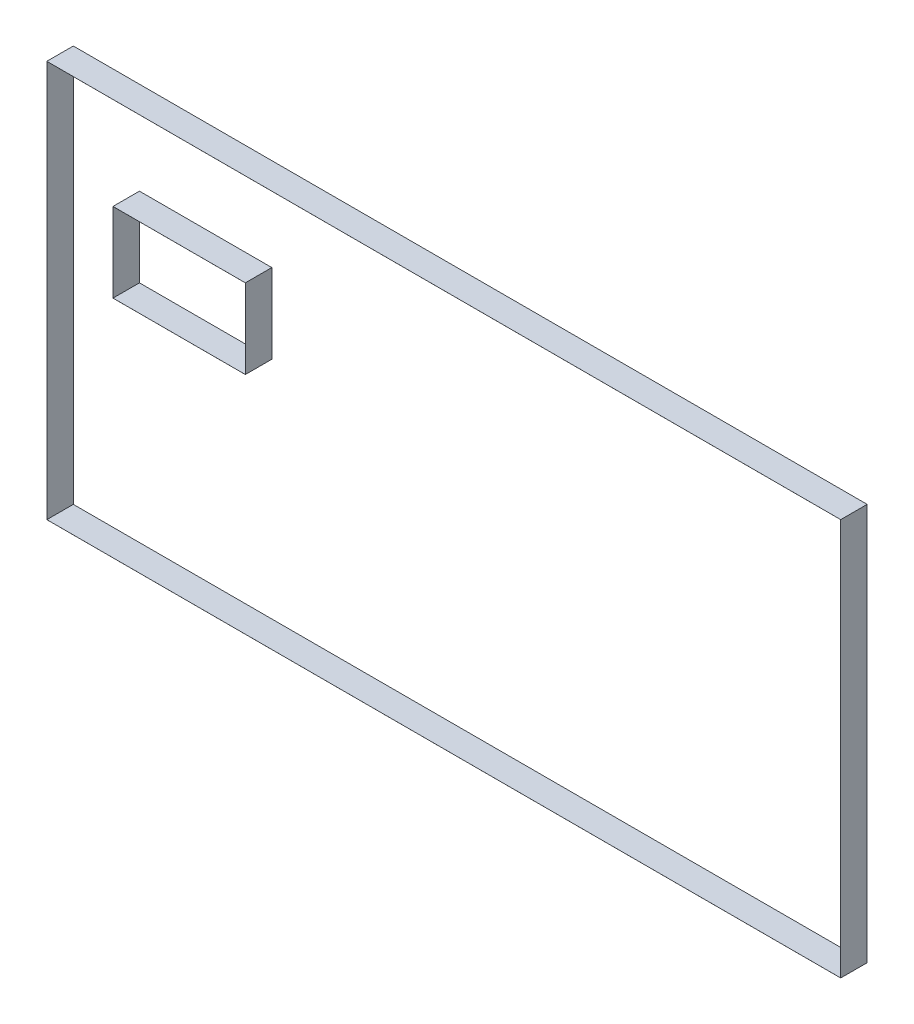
ISO-10303-21;
HEADER;
FILE_DESCRIPTION(('STEP AP214'),'2;1');
FILE_NAME('part.step','',(''),(''),'','','');
FILE_SCHEMA(('AUTOMOTIVE_DESIGN { 1 0 10303 214 1 1 1 1 }'));
ENDSEC;
DATA;
#1=APPLICATION_CONTEXT('core data for automotive mechanical design processes');
#2=APPLICATION_PROTOCOL_DEFINITION('international standard','automotive_design',2000,#1);
#3=PRODUCT_CONTEXT('',#1,'mechanical');
#4=PRODUCT('Part','Part','',(#3));
#5=PRODUCT_RELATED_PRODUCT_CATEGORY('part','',(#4));
#6=PRODUCT_DEFINITION_FORMATION('','',#4);
#7=PRODUCT_DEFINITION_CONTEXT('part definition',#1,'design');
#8=PRODUCT_DEFINITION('design','',#6,#7);
#9=PRODUCT_DEFINITION_SHAPE('','',#8);
#10=(LENGTH_UNIT() NAMED_UNIT(*) SI_UNIT(.MILLI.,.METRE.));
#11=(NAMED_UNIT(*) PLANE_ANGLE_UNIT() SI_UNIT($,.RADIAN.));
#12=(NAMED_UNIT(*) SI_UNIT($,.STERADIAN.) SOLID_ANGLE_UNIT());
#13=UNCERTAINTY_MEASURE_WITH_UNIT(LENGTH_MEASURE(1.E-05),#10,'distance_accuracy_value','');
#14=(GEOMETRIC_REPRESENTATION_CONTEXT(3) GLOBAL_UNCERTAINTY_ASSIGNED_CONTEXT((#13)) GLOBAL_UNIT_ASSIGNED_CONTEXT((#10,
#11,#12)) REPRESENTATION_CONTEXT('',''));
#15=CARTESIAN_POINT('',(0.,0.,0.));
#16=DIRECTION('',(0.,0.,1.));
#17=DIRECTION('',(1.,0.,0.));
#18=AXIS2_PLACEMENT_3D('',#15,#16,#17);
#19=CARTESIAN_POINT('',(0.,0.,1.));
#20=DIRECTION('',(0.,0.,1.));
#21=DIRECTION('',(1.,0.,0.));
#22=AXIS2_PLACEMENT_3D('',#19,#20,#21);
#23=PLANE('',#22);
#24=DIRECTION('',(0.,-1.,0.));
#25=VECTOR('',#24,1.);
#26=CARTESIAN_POINT('',(2.499,11.5,1.));
#27=LINE('',#26,#25);
#28=CARTESIAN_POINT('',(2.499,11.501,1.));
#29=VERTEX_POINT('',#28);
#30=CARTESIAN_POINT('',(2.499,8.499,1.));
#31=VERTEX_POINT('',#30);
#32=EDGE_CURVE('E294',#29,#31,#27,.T.);
#33=ORIENTED_EDGE('',*,*,#32,.T.);
#34=DIRECTION('',(1.,0.,0.));
#35=VECTOR('',#34,1.);
#36=CARTESIAN_POINT('',(2.5,8.499,1.));
#37=LINE('',#36,#35);
#38=CARTESIAN_POINT('',(7.501,8.499,1.));
#39=VERTEX_POINT('',#38);
#40=EDGE_CURVE('E297',#31,#39,#37,.T.);
#41=ORIENTED_EDGE('',*,*,#40,.T.);
#42=DIRECTION('',(0.,1.,0.));
#43=VECTOR('',#42,1.);
#44=CARTESIAN_POINT('',(7.501,11.5,1.));
#45=LINE('',#44,#43);
#46=CARTESIAN_POINT('',(7.501,11.501,1.));
#47=VERTEX_POINT('',#46);
#48=EDGE_CURVE('E300',#39,#47,#45,.T.);
#49=ORIENTED_EDGE('',*,*,#48,.T.);
#50=DIRECTION('',(-1.,0.,0.));
#51=VECTOR('',#50,1.);
#52=CARTESIAN_POINT('',(2.5,11.501,1.));
#53=LINE('',#52,#51);
#54=EDGE_CURVE('E302',#47,#29,#53,.T.);
#55=ORIENTED_EDGE('',*,*,#54,.T.);
#56=EDGE_LOOP('',(#33,#41,#49,#55));
#57=FACE_BOUND('',#56,.T.);
#58=DIRECTION('',(1.,0.,0.));
#59=VECTOR('',#58,1.);
#60=CARTESIAN_POINT('',(2.5,8.5,1.));
#61=LINE('',#60,#59);
#62=CARTESIAN_POINT('',(2.5,8.5,1.));
#63=VERTEX_POINT('',#62);
#64=CARTESIAN_POINT('',(7.5,8.5,1.));
#65=VERTEX_POINT('',#64);
#66=EDGE_CURVE('E266',#63,#65,#61,.T.);
#67=ORIENTED_EDGE('',*,*,#66,.F.);
#68=DIRECTION('',(0.,-1.,0.));
#69=VECTOR('',#68,1.);
#70=CARTESIAN_POINT('',(2.5,11.5,1.));
#71=LINE('',#70,#69);
#72=CARTESIAN_POINT('',(2.5,11.5,1.));
#73=VERTEX_POINT('',#72);
#74=EDGE_CURVE('E258',#73,#63,#71,.T.);
#75=ORIENTED_EDGE('',*,*,#74,.F.);
#76=DIRECTION('',(-1.,0.,0.));
#77=VECTOR('',#76,1.);
#78=CARTESIAN_POINT('',(2.5,11.5,1.));
#79=LINE('',#78,#77);
#80=CARTESIAN_POINT('',(7.5,11.5,1.));
#81=VERTEX_POINT('',#80);
#82=EDGE_CURVE('E280',#81,#73,#79,.T.);
#83=ORIENTED_EDGE('',*,*,#82,.F.);
#84=DIRECTION('',(0.,1.,0.));
#85=VECTOR('',#84,1.);
#86=CARTESIAN_POINT('',(7.5,11.5,1.));
#87=LINE('',#86,#85);
#88=EDGE_CURVE('E278',#65,#81,#87,.T.);
#89=ORIENTED_EDGE('',*,*,#88,.F.);
#90=EDGE_LOOP('',(#67,#75,#83,#89));
#91=FACE_BOUND('',#90,.T.);
#92=ADVANCED_FACE('F193',(#57,#91),#23,.T.);
#93=CARTESIAN_POINT('',(0.,0.,0.));
#94=DIRECTION('',(0.,0.,1.));
#95=DIRECTION('',(1.,0.,0.));
#96=AXIS2_PLACEMENT_3D('',#93,#94,#95);
#97=PLANE('',#96);
#98=DIRECTION('',(0.,-1.,0.));
#99=VECTOR('',#98,1.);
#100=CARTESIAN_POINT('',(2.499,11.5,0.));
#101=LINE('',#100,#99);
#102=CARTESIAN_POINT('',(2.499,11.501,0.));
#103=VERTEX_POINT('',#102);
#104=CARTESIAN_POINT('',(2.499,8.499,0.));
#105=VERTEX_POINT('',#104);
#106=EDGE_CURVE('E274',#103,#105,#101,.T.);
#107=ORIENTED_EDGE('',*,*,#106,.F.);
#108=DIRECTION('',(-1.,0.,0.));
#109=VECTOR('',#108,1.);
#110=CARTESIAN_POINT('',(2.5,11.501,0.));
#111=LINE('',#110,#109);
#112=CARTESIAN_POINT('',(7.501,11.501,0.));
#113=VERTEX_POINT('',#112);
#114=EDGE_CURVE('E298',#113,#103,#111,.T.);
#115=ORIENTED_EDGE('',*,*,#114,.F.);
#116=DIRECTION('',(0.,1.,0.));
#117=VECTOR('',#116,1.);
#118=CARTESIAN_POINT('',(7.501,11.5,0.));
#119=LINE('',#118,#117);
#120=CARTESIAN_POINT('',(7.501,8.499,0.));
#121=VERTEX_POINT('',#120);
#122=EDGE_CURVE('E309',#121,#113,#119,.T.);
#123=ORIENTED_EDGE('',*,*,#122,.F.);
#124=DIRECTION('',(1.,0.,0.));
#125=VECTOR('',#124,1.);
#126=CARTESIAN_POINT('',(2.5,8.499,0.));
#127=LINE('',#126,#125);
#128=EDGE_CURVE('E307',#105,#121,#127,.T.);
#129=ORIENTED_EDGE('',*,*,#128,.F.);
#130=EDGE_LOOP('',(#107,#115,#123,#129));
#131=FACE_BOUND('',#130,.T.);
#132=DIRECTION('',(0.,-1.,0.));
#133=VECTOR('',#132,1.);
#134=CARTESIAN_POINT('',(2.5,11.5,0.));
#135=LINE('',#134,#133);
#136=CARTESIAN_POINT('',(2.5,11.5,0.));
#137=VERTEX_POINT('',#136);
#138=CARTESIAN_POINT('',(2.5,8.5,0.));
#139=VERTEX_POINT('',#138);
#140=EDGE_CURVE('E216',#137,#139,#135,.T.);
#141=ORIENTED_EDGE('',*,*,#140,.T.);
#142=DIRECTION('',(1.,0.,0.));
#143=VECTOR('',#142,1.);
#144=CARTESIAN_POINT('',(2.5,8.5,0.));
#145=LINE('',#144,#143);
#146=CARTESIAN_POINT('',(7.5,8.5,0.));
#147=VERTEX_POINT('',#146);
#148=EDGE_CURVE('E273',#139,#147,#145,.T.);
#149=ORIENTED_EDGE('',*,*,#148,.T.);
#150=DIRECTION('',(0.,1.,0.));
#151=VECTOR('',#150,1.);
#152=CARTESIAN_POINT('',(7.5,11.5,0.));
#153=LINE('',#152,#151);
#154=CARTESIAN_POINT('',(7.5,11.5,0.));
#155=VERTEX_POINT('',#154);
#156=EDGE_CURVE('E286',#147,#155,#153,.T.);
#157=ORIENTED_EDGE('',*,*,#156,.T.);
#158=DIRECTION('',(-1.,0.,0.));
#159=VECTOR('',#158,1.);
#160=CARTESIAN_POINT('',(2.5,11.5,0.));
#161=LINE('',#160,#159);
#162=EDGE_CURVE('E267',#155,#137,#161,.T.);
#163=ORIENTED_EDGE('',*,*,#162,.T.);
#164=EDGE_LOOP('',(#141,#149,#157,#163));
#165=FACE_BOUND('',#164,.T.);
#166=ADVANCED_FACE('F327',(#131,#165),#97,.F.);
#167=CARTESIAN_POINT('',(2.499,11.5,1.));
#168=DIRECTION('',(1.,0.,0.));
#169=DIRECTION('',(0.,1.,0.));
#170=AXIS2_PLACEMENT_3D('',#167,#168,#169);
#171=PLANE('',#170);
#172=ORIENTED_EDGE('',*,*,#106,.T.);
#173=DIRECTION('',(0.,0.,-1.));
#174=VECTOR('',#173,1.);
#175=CARTESIAN_POINT('',(2.499,8.499,1.));
#176=LINE('',#175,#174);
#177=EDGE_CURVE('E13',#31,#105,#176,.T.);
#178=ORIENTED_EDGE('',*,*,#177,.F.);
#179=ORIENTED_EDGE('',*,*,#32,.F.);
#180=DIRECTION('',(0.,0.,-1.));
#181=VECTOR('',#180,1.);
#182=CARTESIAN_POINT('',(2.499,11.501,1.));
#183=LINE('',#182,#181);
#184=EDGE_CURVE('E304',#29,#103,#183,.T.);
#185=ORIENTED_EDGE('',*,*,#184,.T.);
#186=EDGE_LOOP('',(#172,#178,#179,#185));
#187=FACE_BOUND('',#186,.T.);
#188=ADVANCED_FACE('F195',(#187),#171,.F.);
#189=CARTESIAN_POINT('',(2.5,8.499,1.));
#190=DIRECTION('',(0.,1.,0.));
#191=DIRECTION('',(0.,0.,1.));
#192=AXIS2_PLACEMENT_3D('',#189,#190,#191);
#193=PLANE('',#192);
#194=ORIENTED_EDGE('',*,*,#128,.T.);
#195=DIRECTION('',(0.,0.,-1.));
#196=VECTOR('',#195,1.);
#197=CARTESIAN_POINT('',(7.501,8.499,1.));
#198=LINE('',#197,#196);
#199=EDGE_CURVE('E201',#39,#121,#198,.T.);
#200=ORIENTED_EDGE('',*,*,#199,.F.);
#201=ORIENTED_EDGE('',*,*,#40,.F.);
#202=ORIENTED_EDGE('',*,*,#177,.T.);
#203=EDGE_LOOP('',(#194,#200,#201,#202));
#204=FACE_BOUND('',#203,.T.);
#205=ADVANCED_FACE('F337',(#204),#193,.F.);
#206=CARTESIAN_POINT('',(7.501,11.5,1.));
#207=DIRECTION('',(-1.,0.,0.));
#208=DIRECTION('',(0.,0.,1.));
#209=AXIS2_PLACEMENT_3D('',#206,#207,#208);
#210=PLANE('',#209);
#211=ORIENTED_EDGE('',*,*,#122,.T.);
#212=DIRECTION('',(0.,0.,-1.));
#213=VECTOR('',#212,1.);
#214=CARTESIAN_POINT('',(7.501,11.501,1.));
#215=LINE('',#214,#213);
#216=EDGE_CURVE('E314',#47,#113,#215,.T.);
#217=ORIENTED_EDGE('',*,*,#216,.F.);
#218=ORIENTED_EDGE('',*,*,#48,.F.);
#219=ORIENTED_EDGE('',*,*,#199,.T.);
#220=EDGE_LOOP('',(#211,#217,#218,#219));
#221=FACE_BOUND('',#220,.T.);
#222=ADVANCED_FACE('F321',(#221),#210,.F.);
#223=CARTESIAN_POINT('',(2.5,11.501,1.));
#224=DIRECTION('',(0.,-1.,0.));
#225=DIRECTION('',(0.,0.,-1.));
#226=AXIS2_PLACEMENT_3D('',#223,#224,#225);
#227=PLANE('',#226);
#228=ORIENTED_EDGE('',*,*,#114,.T.);
#229=ORIENTED_EDGE('',*,*,#184,.F.);
#230=ORIENTED_EDGE('',*,*,#54,.F.);
#231=ORIENTED_EDGE('',*,*,#216,.T.);
#232=EDGE_LOOP('',(#228,#229,#230,#231));
#233=FACE_BOUND('',#232,.T.);
#234=ADVANCED_FACE('F331',(#233),#227,.F.);
#235=CARTESIAN_POINT('',(2.5,11.5,1.));
#236=DIRECTION('',(1.,0.,0.));
#237=DIRECTION('',(0.,1.,0.));
#238=AXIS2_PLACEMENT_3D('',#235,#236,#237);
#239=PLANE('',#238);
#240=ORIENTED_EDGE('',*,*,#140,.F.);
#241=DIRECTION('',(0.,0.,-1.));
#242=VECTOR('',#241,1.);
#243=CARTESIAN_POINT('',(2.5,11.5,1.));
#244=LINE('',#243,#242);
#245=EDGE_CURVE('E262',#73,#137,#244,.T.);
#246=ORIENTED_EDGE('',*,*,#245,.F.);
#247=ORIENTED_EDGE('',*,*,#74,.T.);
#248=DIRECTION('',(0.,0.,-1.));
#249=VECTOR('',#248,1.);
#250=CARTESIAN_POINT('',(2.5,8.5,1.));
#251=LINE('',#250,#249);
#252=EDGE_CURVE('E261',#63,#139,#251,.T.);
#253=ORIENTED_EDGE('',*,*,#252,.T.);
#254=EDGE_LOOP('',(#240,#246,#247,#253));
#255=FACE_BOUND('',#254,.T.);
#256=ADVANCED_FACE('F260',(#255),#239,.T.);
#257=CARTESIAN_POINT('',(2.5,8.5,1.));
#258=DIRECTION('',(0.,1.,0.));
#259=DIRECTION('',(0.,0.,1.));
#260=AXIS2_PLACEMENT_3D('',#257,#258,#259);
#261=PLANE('',#260);
#262=ORIENTED_EDGE('',*,*,#148,.F.);
#263=ORIENTED_EDGE('',*,*,#252,.F.);
#264=ORIENTED_EDGE('',*,*,#66,.T.);
#265=DIRECTION('',(0.,0.,-1.));
#266=VECTOR('',#265,1.);
#267=CARTESIAN_POINT('',(7.5,8.5,1.));
#268=LINE('',#267,#266);
#269=EDGE_CURVE('E275',#65,#147,#268,.T.);
#270=ORIENTED_EDGE('',*,*,#269,.T.);
#271=EDGE_LOOP('',(#262,#263,#264,#270));
#272=FACE_BOUND('',#271,.T.);
#273=ADVANCED_FACE('F270',(#272),#261,.T.);
#274=CARTESIAN_POINT('',(7.5,11.5,1.));
#275=DIRECTION('',(-1.,0.,0.));
#276=DIRECTION('',(0.,0.,1.));
#277=AXIS2_PLACEMENT_3D('',#274,#275,#276);
#278=PLANE('',#277);
#279=ORIENTED_EDGE('',*,*,#156,.F.);
#280=ORIENTED_EDGE('',*,*,#269,.F.);
#281=ORIENTED_EDGE('',*,*,#88,.T.);
#282=DIRECTION('',(0.,0.,-1.));
#283=VECTOR('',#282,1.);
#284=CARTESIAN_POINT('',(7.5,11.5,1.));
#285=LINE('',#284,#283);
#286=EDGE_CURVE('E208',#81,#155,#285,.T.);
#287=ORIENTED_EDGE('',*,*,#286,.T.);
#288=EDGE_LOOP('',(#279,#280,#281,#287));
#289=FACE_BOUND('',#288,.T.);
#290=ADVANCED_FACE('F360',(#289),#278,.T.);
#291=CARTESIAN_POINT('',(2.5,11.5,1.));
#292=DIRECTION('',(0.,-1.,0.));
#293=DIRECTION('',(0.,0.,-1.));
#294=AXIS2_PLACEMENT_3D('',#291,#292,#293);
#295=PLANE('',#294);
#296=ORIENTED_EDGE('',*,*,#162,.F.);
#297=ORIENTED_EDGE('',*,*,#286,.F.);
#298=ORIENTED_EDGE('',*,*,#82,.T.);
#299=ORIENTED_EDGE('',*,*,#245,.T.);
#300=EDGE_LOOP('',(#296,#297,#298,#299));
#301=FACE_BOUND('',#300,.T.);
#302=ADVANCED_FACE('F364',(#301),#295,.T.);
#303=CLOSED_SHELL('',(#92,#166,#188,#205,#222,#234,#256,#273,#290,#302));
#304=MANIFOLD_SOLID_BREP('B2',#303);
#305=CARTESIAN_POINT('',(0.,0.,1.));
#306=DIRECTION('',(0.,0.,1.));
#307=DIRECTION('',(1.,0.,0.));
#308=AXIS2_PLACEMENT_3D('',#305,#306,#307);
#309=PLANE('',#308);
#310=DIRECTION('',(0.,-1.,0.));
#311=VECTOR('',#310,1.);
#312=CARTESIAN_POINT('',(-0.001,0.,1.));
#313=LINE('',#312,#311);
#314=CARTESIAN_POINT('',(-0.001,15.001,1.));
#315=VERTEX_POINT('',#314);
#316=CARTESIAN_POINT('',(-0.001,-0.001,1.));
#317=VERTEX_POINT('',#316);
#318=EDGE_CURVE('E564',#315,#317,#313,.T.);
#319=ORIENTED_EDGE('',*,*,#318,.T.);
#320=DIRECTION('',(1.,0.,0.));
#321=VECTOR('',#320,1.);
#322=CARTESIAN_POINT('',(0.,-0.001,1.));
#323=LINE('',#322,#321);
#324=CARTESIAN_POINT('',(30.001,-0.001,1.));
#325=VERTEX_POINT('',#324);
#326=EDGE_CURVE('E567',#317,#325,#323,.T.);
#327=ORIENTED_EDGE('',*,*,#326,.T.);
#328=DIRECTION('',(0.,1.,0.));
#329=VECTOR('',#328,1.);
#330=CARTESIAN_POINT('',(30.001,0.,1.));
#331=LINE('',#330,#329);
#332=CARTESIAN_POINT('',(30.001,15.001,1.));
#333=VERTEX_POINT('',#332);
#334=EDGE_CURVE('E570',#325,#333,#331,.T.);
#335=ORIENTED_EDGE('',*,*,#334,.T.);
#336=DIRECTION('',(-1.,0.,0.));
#337=VECTOR('',#336,1.);
#338=CARTESIAN_POINT('',(0.,15.001,1.));
#339=LINE('',#338,#337);
#340=EDGE_CURVE('E572',#333,#315,#339,.T.);
#341=ORIENTED_EDGE('',*,*,#340,.T.);
#342=EDGE_LOOP('',(#319,#327,#335,#341));
#343=FACE_BOUND('',#342,.T.);
#344=DIRECTION('',(1.,0.,0.));
#345=VECTOR('',#344,1.);
#346=CARTESIAN_POINT('',(0.,0.,1.));
#347=LINE('',#346,#345);
#348=CARTESIAN_POINT('',(0.,0.,1.));
#349=VERTEX_POINT('',#348);
#350=CARTESIAN_POINT('',(30.,0.,1.));
#351=VERTEX_POINT('',#350);
#352=EDGE_CURVE('E536',#349,#351,#347,.T.);
#353=ORIENTED_EDGE('',*,*,#352,.F.);
#354=DIRECTION('',(0.,-1.,0.));
#355=VECTOR('',#354,1.);
#356=CARTESIAN_POINT('',(0.,0.,1.));
#357=LINE('',#356,#355);
#358=CARTESIAN_POINT('',(0.,15.,1.));
#359=VERTEX_POINT('',#358);
#360=EDGE_CURVE('E528',#359,#349,#357,.T.);
#361=ORIENTED_EDGE('',*,*,#360,.F.);
#362=DIRECTION('',(-1.,0.,0.));
#363=VECTOR('',#362,1.);
#364=CARTESIAN_POINT('',(0.,15.,1.));
#365=LINE('',#364,#363);
#366=CARTESIAN_POINT('',(30.,15.,1.));
#367=VERTEX_POINT('',#366);
#368=EDGE_CURVE('E550',#367,#359,#365,.T.);
#369=ORIENTED_EDGE('',*,*,#368,.F.);
#370=DIRECTION('',(0.,1.,0.));
#371=VECTOR('',#370,1.);
#372=CARTESIAN_POINT('',(30.,0.,1.));
#373=LINE('',#372,#371);
#374=EDGE_CURVE('E548',#351,#367,#373,.T.);
#375=ORIENTED_EDGE('',*,*,#374,.F.);
#376=EDGE_LOOP('',(#353,#361,#369,#375));
#377=FACE_BOUND('',#376,.T.);
#378=ADVANCED_FACE('F463',(#343,#377),#309,.T.);
#379=CARTESIAN_POINT('',(0.,0.,0.));
#380=DIRECTION('',(0.,0.,1.));
#381=DIRECTION('',(1.,0.,0.));
#382=AXIS2_PLACEMENT_3D('',#379,#380,#381);
#383=PLANE('',#382);
#384=DIRECTION('',(0.,-1.,0.));
#385=VECTOR('',#384,1.);
#386=CARTESIAN_POINT('',(-0.001,0.,0.));
#387=LINE('',#386,#385);
#388=CARTESIAN_POINT('',(-0.001,15.001,0.));
#389=VERTEX_POINT('',#388);
#390=CARTESIAN_POINT('',(-0.001,-0.001,0.));
#391=VERTEX_POINT('',#390);
#392=EDGE_CURVE('E544',#389,#391,#387,.T.);
#393=ORIENTED_EDGE('',*,*,#392,.F.);
#394=DIRECTION('',(-1.,0.,0.));
#395=VECTOR('',#394,1.);
#396=CARTESIAN_POINT('',(0.,15.001,0.));
#397=LINE('',#396,#395);
#398=CARTESIAN_POINT('',(30.001,15.001,0.));
#399=VERTEX_POINT('',#398);
#400=EDGE_CURVE('E568',#399,#389,#397,.T.);
#401=ORIENTED_EDGE('',*,*,#400,.F.);
#402=DIRECTION('',(0.,1.,0.));
#403=VECTOR('',#402,1.);
#404=CARTESIAN_POINT('',(30.001,0.,0.));
#405=LINE('',#404,#403);
#406=CARTESIAN_POINT('',(30.001,-0.001,0.));
#407=VERTEX_POINT('',#406);
#408=EDGE_CURVE('E579',#407,#399,#405,.T.);
#409=ORIENTED_EDGE('',*,*,#408,.F.);
#410=DIRECTION('',(1.,0.,0.));
#411=VECTOR('',#410,1.);
#412=CARTESIAN_POINT('',(0.,-0.001,0.));
#413=LINE('',#412,#411);
#414=EDGE_CURVE('E577',#391,#407,#413,.T.);
#415=ORIENTED_EDGE('',*,*,#414,.F.);
#416=EDGE_LOOP('',(#393,#401,#409,#415));
#417=FACE_BOUND('',#416,.T.);
#418=DIRECTION('',(0.,-1.,0.));
#419=VECTOR('',#418,1.);
#420=CARTESIAN_POINT('',(0.,0.,0.));
#421=LINE('',#420,#419);
#422=CARTESIAN_POINT('',(0.,15.,0.));
#423=VERTEX_POINT('',#422);
#424=CARTESIAN_POINT('',(0.,0.,0.));
#425=VERTEX_POINT('',#424);
#426=EDGE_CURVE('E486',#423,#425,#421,.T.);
#427=ORIENTED_EDGE('',*,*,#426,.T.);
#428=DIRECTION('',(1.,0.,0.));
#429=VECTOR('',#428,1.);
#430=CARTESIAN_POINT('',(0.,0.,0.));
#431=LINE('',#430,#429);
#432=CARTESIAN_POINT('',(30.,0.,0.));
#433=VERTEX_POINT('',#432);
#434=EDGE_CURVE('E543',#425,#433,#431,.T.);
#435=ORIENTED_EDGE('',*,*,#434,.T.);
#436=DIRECTION('',(0.,1.,0.));
#437=VECTOR('',#436,1.);
#438=CARTESIAN_POINT('',(30.,0.,0.));
#439=LINE('',#438,#437);
#440=CARTESIAN_POINT('',(30.,15.,0.));
#441=VERTEX_POINT('',#440);
#442=EDGE_CURVE('E556',#433,#441,#439,.T.);
#443=ORIENTED_EDGE('',*,*,#442,.T.);
#444=DIRECTION('',(-1.,0.,0.));
#445=VECTOR('',#444,1.);
#446=CARTESIAN_POINT('',(0.,15.,0.));
#447=LINE('',#446,#445);
#448=EDGE_CURVE('E537',#441,#423,#447,.T.);
#449=ORIENTED_EDGE('',*,*,#448,.T.);
#450=EDGE_LOOP('',(#427,#435,#443,#449));
#451=FACE_BOUND('',#450,.T.);
#452=ADVANCED_FACE('F597',(#417,#451),#383,.F.);
#453=CARTESIAN_POINT('',(-0.001,0.,1.));
#454=DIRECTION('',(1.,0.,0.));
#455=DIRECTION('',(0.,0.,-1.));
#456=AXIS2_PLACEMENT_3D('',#453,#454,#455);
#457=PLANE('',#456);
#458=ORIENTED_EDGE('',*,*,#392,.T.);
#459=DIRECTION('',(0.,0.,-1.));
#460=VECTOR('',#459,1.);
#461=CARTESIAN_POINT('',(-0.001,-0.001,1.));
#462=LINE('',#461,#460);
#463=EDGE_CURVE('E191',#317,#391,#462,.T.);
#464=ORIENTED_EDGE('',*,*,#463,.F.);
#465=ORIENTED_EDGE('',*,*,#318,.F.);
#466=DIRECTION('',(0.,0.,-1.));
#467=VECTOR('',#466,1.);
#468=CARTESIAN_POINT('',(-0.001,15.001,1.));
#469=LINE('',#468,#467);
#470=EDGE_CURVE('E574',#315,#389,#469,.T.);
#471=ORIENTED_EDGE('',*,*,#470,.T.);
#472=EDGE_LOOP('',(#458,#464,#465,#471));
#473=FACE_BOUND('',#472,.T.);
#474=ADVANCED_FACE('F465',(#473),#457,.F.);
#475=CARTESIAN_POINT('',(0.,-0.001,1.));
#476=DIRECTION('',(0.,1.,0.));
#477=DIRECTION('',(0.,0.,1.));
#478=AXIS2_PLACEMENT_3D('',#475,#476,#477);
#479=PLANE('',#478);
#480=ORIENTED_EDGE('',*,*,#414,.T.);
#481=DIRECTION('',(0.,0.,-1.));
#482=VECTOR('',#481,1.);
#483=CARTESIAN_POINT('',(30.001,-0.001,1.));
#484=LINE('',#483,#482);
#485=EDGE_CURVE('E471',#325,#407,#484,.T.);
#486=ORIENTED_EDGE('',*,*,#485,.F.);
#487=ORIENTED_EDGE('',*,*,#326,.F.);
#488=ORIENTED_EDGE('',*,*,#463,.T.);
#489=EDGE_LOOP('',(#480,#486,#487,#488));
#490=FACE_BOUND('',#489,.T.);
#491=ADVANCED_FACE('F607',(#490),#479,.F.);
#492=CARTESIAN_POINT('',(30.001,0.,1.));
#493=DIRECTION('',(-1.,0.,0.));
#494=DIRECTION('',(0.,0.,1.));
#495=AXIS2_PLACEMENT_3D('',#492,#493,#494);
#496=PLANE('',#495);
#497=ORIENTED_EDGE('',*,*,#408,.T.);
#498=DIRECTION('',(0.,0.,-1.));
#499=VECTOR('',#498,1.);
#500=CARTESIAN_POINT('',(30.001,15.001,1.));
#501=LINE('',#500,#499);
#502=EDGE_CURVE('E584',#333,#399,#501,.T.);
#503=ORIENTED_EDGE('',*,*,#502,.F.);
#504=ORIENTED_EDGE('',*,*,#334,.F.);
#505=ORIENTED_EDGE('',*,*,#485,.T.);
#506=EDGE_LOOP('',(#497,#503,#504,#505));
#507=FACE_BOUND('',#506,.T.);
#508=ADVANCED_FACE('F591',(#507),#496,.F.);
#509=CARTESIAN_POINT('',(0.,15.001,1.));
#510=DIRECTION('',(0.,-1.,0.));
#511=DIRECTION('',(0.,0.,-1.));
#512=AXIS2_PLACEMENT_3D('',#509,#510,#511);
#513=PLANE('',#512);
#514=ORIENTED_EDGE('',*,*,#400,.T.);
#515=ORIENTED_EDGE('',*,*,#470,.F.);
#516=ORIENTED_EDGE('',*,*,#340,.F.);
#517=ORIENTED_EDGE('',*,*,#502,.T.);
#518=EDGE_LOOP('',(#514,#515,#516,#517));
#519=FACE_BOUND('',#518,.T.);
#520=ADVANCED_FACE('F601',(#519),#513,.F.);
#521=CARTESIAN_POINT('',(0.,0.,1.));
#522=DIRECTION('',(1.,0.,0.));
#523=DIRECTION('',(0.,0.,-1.));
#524=AXIS2_PLACEMENT_3D('',#521,#522,#523);
#525=PLANE('',#524);
#526=ORIENTED_EDGE('',*,*,#426,.F.);
#527=DIRECTION('',(0.,0.,-1.));
#528=VECTOR('',#527,1.);
#529=CARTESIAN_POINT('',(0.,15.,1.));
#530=LINE('',#529,#528);
#531=EDGE_CURVE('E532',#359,#423,#530,.T.);
#532=ORIENTED_EDGE('',*,*,#531,.F.);
#533=ORIENTED_EDGE('',*,*,#360,.T.);
#534=DIRECTION('',(0.,0.,-1.));
#535=VECTOR('',#534,1.);
#536=CARTESIAN_POINT('',(0.,0.,1.));
#537=LINE('',#536,#535);
#538=EDGE_CURVE('E531',#349,#425,#537,.T.);
#539=ORIENTED_EDGE('',*,*,#538,.T.);
#540=EDGE_LOOP('',(#526,#532,#533,#539));
#541=FACE_BOUND('',#540,.T.);
#542=ADVANCED_FACE('F530',(#541),#525,.T.);
#543=CARTESIAN_POINT('',(0.,0.,1.));
#544=DIRECTION('',(0.,1.,0.));
#545=DIRECTION('',(0.,0.,1.));
#546=AXIS2_PLACEMENT_3D('',#543,#544,#545);
#547=PLANE('',#546);
#548=ORIENTED_EDGE('',*,*,#434,.F.);
#549=ORIENTED_EDGE('',*,*,#538,.F.);
#550=ORIENTED_EDGE('',*,*,#352,.T.);
#551=DIRECTION('',(0.,0.,-1.));
#552=VECTOR('',#551,1.);
#553=CARTESIAN_POINT('',(30.,0.,1.));
#554=LINE('',#553,#552);
#555=EDGE_CURVE('E545',#351,#433,#554,.T.);
#556=ORIENTED_EDGE('',*,*,#555,.T.);
#557=EDGE_LOOP('',(#548,#549,#550,#556));
#558=FACE_BOUND('',#557,.T.);
#559=ADVANCED_FACE('F540',(#558),#547,.T.);
#560=CARTESIAN_POINT('',(30.,0.,1.));
#561=DIRECTION('',(-1.,0.,0.));
#562=DIRECTION('',(0.,0.,1.));
#563=AXIS2_PLACEMENT_3D('',#560,#561,#562);
#564=PLANE('',#563);
#565=ORIENTED_EDGE('',*,*,#442,.F.);
#566=ORIENTED_EDGE('',*,*,#555,.F.);
#567=ORIENTED_EDGE('',*,*,#374,.T.);
#568=DIRECTION('',(0.,0.,-1.));
#569=VECTOR('',#568,1.);
#570=CARTESIAN_POINT('',(30.,15.,1.));
#571=LINE('',#570,#569);
#572=EDGE_CURVE('E478',#367,#441,#571,.T.);
#573=ORIENTED_EDGE('',*,*,#572,.T.);
#574=EDGE_LOOP('',(#565,#566,#567,#573));
#575=FACE_BOUND('',#574,.T.);
#576=ADVANCED_FACE('F630',(#575),#564,.T.);
#577=CARTESIAN_POINT('',(0.,15.,1.));
#578=DIRECTION('',(0.,-1.,0.));
#579=DIRECTION('',(0.,0.,-1.));
#580=AXIS2_PLACEMENT_3D('',#577,#578,#579);
#581=PLANE('',#580);
#582=ORIENTED_EDGE('',*,*,#448,.F.);
#583=ORIENTED_EDGE('',*,*,#572,.F.);
#584=ORIENTED_EDGE('',*,*,#368,.T.);
#585=ORIENTED_EDGE('',*,*,#531,.T.);
#586=EDGE_LOOP('',(#582,#583,#584,#585));
#587=FACE_BOUND('',#586,.T.);
#588=ADVANCED_FACE('F634',(#587),#581,.T.);
#589=CLOSED_SHELL('',(#378,#452,#474,#491,#508,#520,#542,#559,#576,#588));
#590=MANIFOLD_SOLID_BREP('B7',#589);
#591=ADVANCED_BREP_SHAPE_REPRESENTATION('',(#18,#304,#590),#14);
#592=SHAPE_DEFINITION_REPRESENTATION(#9,#591);
ENDSEC;
END-ISO-10303-21;
